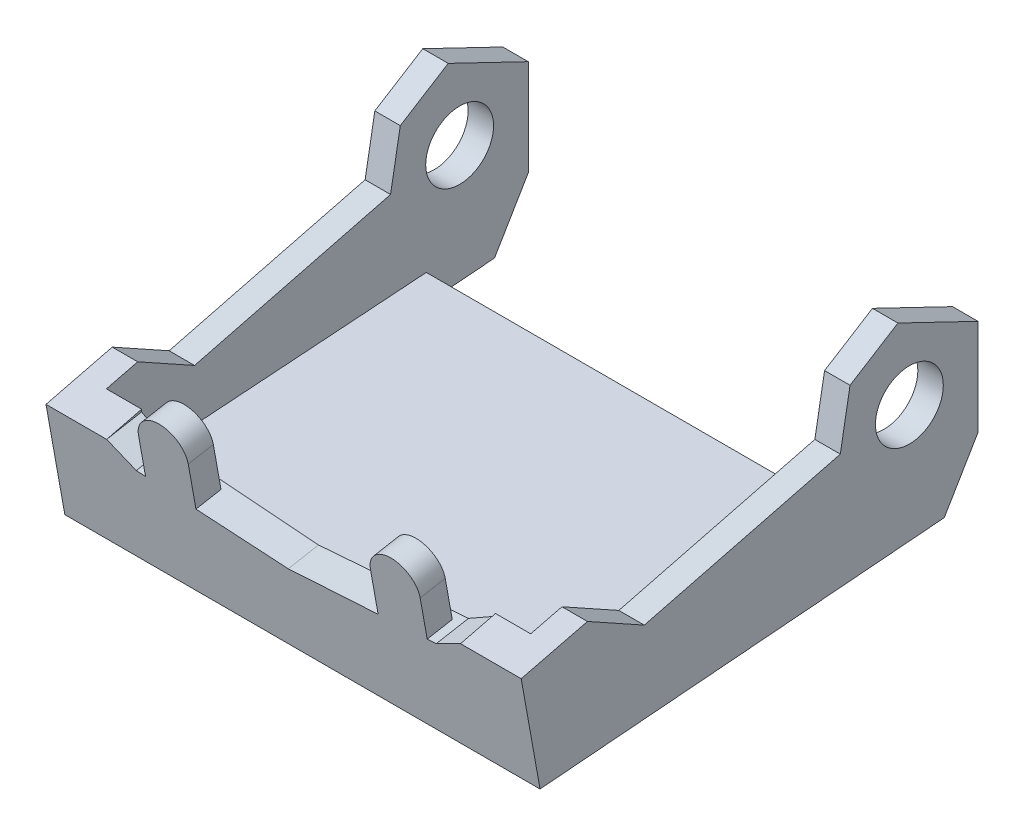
ISO-10303-21;
HEADER;
FILE_DESCRIPTION(('STEP AP214'),'2;1');
FILE_NAME('part.step','',(''),(''),'','','');
FILE_SCHEMA(('AUTOMOTIVE_DESIGN { 1 0 10303 214 1 1 1 1 }'));
ENDSEC;
DATA;
#1=APPLICATION_CONTEXT('core data for automotive mechanical design processes');
#2=APPLICATION_PROTOCOL_DEFINITION('international standard','automotive_design',2000,#1);
#3=PRODUCT_CONTEXT('',#1,'mechanical');
#4=PRODUCT('Part','Part','',(#3));
#5=PRODUCT_RELATED_PRODUCT_CATEGORY('part','',(#4));
#6=PRODUCT_DEFINITION_FORMATION('','',#4);
#7=PRODUCT_DEFINITION_CONTEXT('part definition',#1,'design');
#8=PRODUCT_DEFINITION('design','',#6,#7);
#9=PRODUCT_DEFINITION_SHAPE('','',#8);
#10=(LENGTH_UNIT() NAMED_UNIT(*) SI_UNIT(.MILLI.,.METRE.));
#11=(NAMED_UNIT(*) PLANE_ANGLE_UNIT() SI_UNIT($,.RADIAN.));
#12=(NAMED_UNIT(*) SI_UNIT($,.STERADIAN.) SOLID_ANGLE_UNIT());
#13=UNCERTAINTY_MEASURE_WITH_UNIT(LENGTH_MEASURE(1.E-05),#10,'distance_accuracy_value','');
#14=(GEOMETRIC_REPRESENTATION_CONTEXT(3) GLOBAL_UNCERTAINTY_ASSIGNED_CONTEXT((#13)) GLOBAL_UNIT_ASSIGNED_CONTEXT((#10,
#11,#12)) REPRESENTATION_CONTEXT('',''));
#15=CARTESIAN_POINT('',(0.,0.,0.));
#16=DIRECTION('',(0.,0.,1.));
#17=DIRECTION('',(1.,0.,0.));
#18=AXIS2_PLACEMENT_3D('',#15,#16,#17);
#19=CARTESIAN_POINT('',(-28.,-7.70006673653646,-24.7147024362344));
#20=DIRECTION('',(0.,-0.50924328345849,-0.860622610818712));
#21=DIRECTION('',(0.,0.860622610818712,-0.50924328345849));
#22=AXIS2_PLACEMENT_3D('',#19,#20,#21);
#23=PLANE('',#22);
#24=DIRECTION('',(0.,0.860622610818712,-0.50924328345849));
#25=VECTOR('',#24,1.);
#26=CARTESIAN_POINT('',(-25.,-7.70006673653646,-24.7147024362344));
#27=LINE('',#26,#25);
#28=CARTESIAN_POINT('',(-25.,-14.410289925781,-20.7441629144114));
#29=VERTEX_POINT('',#28);
#30=CARTESIAN_POINT('',(-25.,-7.70006673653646,-24.7147024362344));
#31=VERTEX_POINT('',#30);
#32=EDGE_CURVE('E519',#29,#31,#27,.T.);
#33=ORIENTED_EDGE('',*,*,#32,.F.);
#34=DIRECTION('',(1.,0.,0.));
#35=VECTOR('',#34,1.);
#36=CARTESIAN_POINT('',(-28.,-14.410289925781,-20.7441629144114));
#37=LINE('',#36,#35);
#38=CARTESIAN_POINT('',(-28.,-14.410289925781,-20.7441629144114));
#39=VERTEX_POINT('',#38);
#40=EDGE_CURVE('E365',#39,#29,#37,.T.);
#41=ORIENTED_EDGE('',*,*,#40,.F.);
#42=DIRECTION('',(0.,0.860622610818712,-0.50924328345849));
#43=VECTOR('',#42,1.);
#44=CARTESIAN_POINT('',(-28.,-7.70006673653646,-24.7147024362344));
#45=LINE('',#44,#43);
#46=CARTESIAN_POINT('',(-28.,-7.70006673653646,-24.7147024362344));
#47=VERTEX_POINT('',#46);
#48=EDGE_CURVE('E612',#39,#47,#45,.T.);
#49=ORIENTED_EDGE('',*,*,#48,.T.);
#50=DIRECTION('',(1.,0.,0.));
#51=VECTOR('',#50,1.);
#52=CARTESIAN_POINT('',(-28.,-7.70006673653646,-24.7147024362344));
#53=LINE('',#52,#51);
#54=EDGE_CURVE('E645',#47,#31,#53,.T.);
#55=ORIENTED_EDGE('',*,*,#54,.T.);
#56=EDGE_LOOP('',(#33,#41,#49,#55));
#57=FACE_BOUND('',#56,.T.);
#58=ADVANCED_FACE('F39',(#57),#23,.T.);
#59=CARTESIAN_POINT('',(25.,-14.410289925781,-20.7441629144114));
#60=VERTEX_POINT('',#59);
#61=CARTESIAN_POINT('',(28.,-14.410289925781,-20.7441629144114));
#62=VERTEX_POINT('',#61);
#63=EDGE_CURVE('E651',#60,#62,#37,.T.);
#64=ORIENTED_EDGE('',*,*,#63,.F.);
#65=DIRECTION('',(0.,0.860622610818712,-0.50924328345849));
#66=VECTOR('',#65,1.);
#67=CARTESIAN_POINT('',(25.,-7.70006673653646,-24.7147024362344));
#68=LINE('',#67,#66);
#69=CARTESIAN_POINT('',(25.,-7.70006673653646,-24.7147024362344));
#70=VERTEX_POINT('',#69);
#71=EDGE_CURVE('E546',#60,#70,#68,.T.);
#72=ORIENTED_EDGE('',*,*,#71,.T.);
#73=CARTESIAN_POINT('',(28.,-7.70006673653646,-24.7147024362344));
#74=VERTEX_POINT('',#73);
#75=EDGE_CURVE('E649',#70,#74,#53,.T.);
#76=ORIENTED_EDGE('',*,*,#75,.T.);
#77=DIRECTION('',(0.,0.860622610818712,-0.50924328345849));
#78=VECTOR('',#77,1.);
#79=CARTESIAN_POINT('',(28.,-7.70006673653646,-24.7147024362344));
#80=LINE('',#79,#78);
#81=EDGE_CURVE('E574',#62,#74,#80,.T.);
#82=ORIENTED_EDGE('',*,*,#81,.F.);
#83=EDGE_LOOP('',(#64,#72,#76,#82));
#84=FACE_BOUND('',#83,.T.);
#85=ADVANCED_FACE('F752',(#84),#23,.T.);
#86=CARTESIAN_POINT('',(-28.,-14.410289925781,-20.7441629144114));
#87=DIRECTION('',(0.,-0.996707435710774,-0.0810819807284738));
#88=DIRECTION('',(0.,0.0810819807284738,-0.996707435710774));
#89=AXIS2_PLACEMENT_3D('',#86,#87,#88);
#90=PLANE('',#89);
#91=ORIENTED_EDGE('',*,*,#40,.T.);
#92=DIRECTION('',(0.,-0.0810819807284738,0.996707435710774));
#93=VECTOR('',#92,1.);
#94=CARTESIAN_POINT('',(-25.,-14.410289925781,-20.7441629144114));
#95=LINE('',#94,#93);
#96=CARTESIAN_POINT('',(-25.,-15.0648179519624,-12.6983191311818));
#97=VERTEX_POINT('',#96);
#98=EDGE_CURVE('E357',#29,#97,#95,.T.);
#99=ORIENTED_EDGE('',*,*,#98,.T.);
#100=DIRECTION('',(-1.,0.,0.));
#101=VECTOR('',#100,1.);
#102=CARTESIAN_POINT('',(-28.,-15.0648179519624,-12.6983191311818));
#103=LINE('',#102,#101);
#104=CARTESIAN_POINT('',(25.,-15.0648179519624,-12.6983191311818));
#105=VERTEX_POINT('',#104);
#106=EDGE_CURVE('E342',#105,#97,#103,.T.);
#107=ORIENTED_EDGE('',*,*,#106,.F.);
#108=DIRECTION('',(0.,0.0810819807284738,-0.996707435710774));
#109=VECTOR('',#108,1.);
#110=CARTESIAN_POINT('',(25.,-14.410289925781,-20.7441629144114));
#111=LINE('',#110,#109);
#112=EDGE_CURVE('E350',#105,#60,#111,.T.);
#113=ORIENTED_EDGE('',*,*,#112,.T.);
#114=ORIENTED_EDGE('',*,*,#63,.T.);
#115=DIRECTION('',(0.,0.0810819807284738,-0.996707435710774));
#116=VECTOR('',#115,1.);
#117=CARTESIAN_POINT('',(28.,-14.410289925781,-20.7441629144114));
#118=LINE('',#117,#116);
#119=CARTESIAN_POINT('',(28.,-18.2859613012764,26.8978710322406));
#120=VERTEX_POINT('',#119);
#121=EDGE_CURVE('E570',#120,#62,#118,.T.);
#122=ORIENTED_EDGE('',*,*,#121,.F.);
#123=DIRECTION('',(1.,0.,0.));
#124=VECTOR('',#123,1.);
#125=CARTESIAN_POINT('',(-28.,-18.2859613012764,26.8978710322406));
#126=LINE('',#125,#124);
#127=CARTESIAN_POINT('',(-28.,-18.2859613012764,26.8978710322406));
#128=VERTEX_POINT('',#127);
#129=EDGE_CURVE('E652',#128,#120,#126,.T.);
#130=ORIENTED_EDGE('',*,*,#129,.F.);
#131=DIRECTION('',(0.,0.0810819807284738,-0.996707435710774));
#132=VECTOR('',#131,1.);
#133=CARTESIAN_POINT('',(-28.,-14.410289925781,-20.7441629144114));
#134=LINE('',#133,#132);
#135=EDGE_CURVE('E610',#128,#39,#134,.T.);
#136=ORIENTED_EDGE('',*,*,#135,.T.);
#137=EDGE_LOOP('',(#91,#99,#107,#113,#114,#122,#130,#136));
#138=FACE_BOUND('',#137,.T.);
#139=ADVANCED_FACE('F363',(#138),#90,.T.);
#140=CARTESIAN_POINT('',(-17.6739458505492,2.13757325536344,-25.8000364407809));
#141=DIRECTION('',(-0.0747465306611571,-0.981513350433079,-0.176194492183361));
#142=DIRECTION('',(0.,0.176688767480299,-0.984266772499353));
#143=AXIS2_PLACEMENT_3D('',#140,#141,#142);
#144=PLANE('',#143);
#145=DIRECTION('',(0.,0.176688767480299,-0.984266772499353));
#146=VECTOR('',#145,1.);
#147=CARTESIAN_POINT('',(-10.7337355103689,1.62554596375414,-25.8919520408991));
#148=LINE('',#147,#146);
#149=CARTESIAN_POINT('',(-10.7337355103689,-8.17668895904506,28.7126177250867));
#150=VERTEX_POINT('',#149);
#151=CARTESIAN_POINT('',(-10.7337355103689,-7.64662265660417,25.7598174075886));
#152=VERTEX_POINT('',#151);
#153=EDGE_CURVE('E11',#150,#152,#148,.T.);
#154=ORIENTED_EDGE('',*,*,#153,.F.);
#155=DIRECTION('',(0.997202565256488,-0.073570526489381,-0.0132068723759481));
#156=VECTOR('',#155,1.);
#157=CARTESIAN_POINT('',(-17.6739458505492,-7.66466166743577,28.8045333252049));
#158=LINE('',#157,#156);
#159=CARTESIAN_POINT('',(0.,-8.96859082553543,28.5704609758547));
#160=VERTEX_POINT('',#159);
#161=EDGE_CURVE('E448',#150,#160,#158,.T.);
#162=ORIENTED_EDGE('',*,*,#161,.T.);
#163=DIRECTION('',(0.,-0.176688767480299,0.984266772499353));
#164=VECTOR('',#163,1.);
#165=CARTESIAN_POINT('',(0.,0.83364409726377,-26.0341087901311));
#166=LINE('',#165,#164);
#167=CARTESIAN_POINT('',(0.,-8.32764635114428,25.));
#168=VERTEX_POINT('',#167);
#169=EDGE_CURVE('E469',#168,#160,#166,.T.);
#170=ORIENTED_EDGE('',*,*,#169,.F.);
#171=DIRECTION('',(-0.997112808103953,0.0759344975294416,0.));
#172=VECTOR('',#171,1.);
#173=CARTESIAN_POINT('',(25.0581867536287,-10.2359367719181,25.));
#174=LINE('',#173,#172);
#175=CARTESIAN_POINT('',(-17.6739458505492,-6.98169814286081,25.));
#176=VERTEX_POINT('',#175);
#177=EDGE_CURVE('E688',#168,#176,#174,.T.);
#178=ORIENTED_EDGE('',*,*,#177,.T.);
#179=DIRECTION('',(0.,-0.176688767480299,0.984266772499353));
#180=VECTOR('',#179,1.);
#181=CARTESIAN_POINT('',(-17.6739458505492,2.13757325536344,-25.8000364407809));
#182=LINE('',#181,#180);
#183=CARTESIAN_POINT('',(-17.6739458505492,-7.66466166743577,28.8045333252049));
#184=VERTEX_POINT('',#183);
#185=EDGE_CURVE('E473',#176,#184,#182,.T.);
#186=ORIENTED_EDGE('',*,*,#185,.T.);
#187=CARTESIAN_POINT('',(-16.5955249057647,-7.74422423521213,28.7902508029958));
#188=VERTEX_POINT('',#187);
#189=EDGE_CURVE('E449',#184,#188,#158,.T.);
#190=ORIENTED_EDGE('',*,*,#189,.T.);
#191=DIRECTION('',(0.,-0.176688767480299,0.984266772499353));
#192=VECTOR('',#191,1.);
#193=CARTESIAN_POINT('',(-16.5955249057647,2.05801068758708,-25.8143189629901));
#194=LINE('',#193,#192);
#195=CARTESIAN_POINT('',(-16.5955249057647,-7.21415793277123,25.8374504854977));
#196=VERTEX_POINT('',#195);
#197=EDGE_CURVE('E49',#196,#188,#194,.T.);
#198=ORIENTED_EDGE('',*,*,#197,.F.);
#199=DIRECTION('',(-0.997202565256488,0.0735705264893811,0.0132068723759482));
#200=VECTOR('',#199,1.);
#201=CARTESIAN_POINT('',(-17.6739458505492,-7.13459536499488,25.8517330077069));
#202=LINE('',#201,#200);
#203=EDGE_CURVE('E715',#152,#196,#202,.T.);
#204=ORIENTED_EDGE('',*,*,#203,.F.);
#205=EDGE_LOOP('',(#154,#162,#170,#178,#186,#190,#198,#204));
#206=FACE_BOUND('',#205,.T.);
#207=ADVANCED_FACE('F736',(#206),#144,.F.);
#208=CARTESIAN_POINT('',(-28.,-5.9156990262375,29.1184950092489));
#209=DIRECTION('',(0.,0.97052444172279,0.241002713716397));
#210=DIRECTION('',(0.,-0.241002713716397,0.97052444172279));
#211=AXIS2_PLACEMENT_3D('',#208,#209,#210);
#212=PLANE('',#211);
#213=DIRECTION('',(0.,-0.241002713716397,0.97052444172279));
#214=VECTOR('',#213,1.);
#215=CARTESIAN_POINT('',(-20.8512729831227,-5.9156990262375,29.1184950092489));
#216=LINE('',#215,#214);
#217=CARTESIAN_POINT('',(-20.8512729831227,-4.89298550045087,25.));
#218=VERTEX_POINT('',#217);
#219=CARTESIAN_POINT('',(-20.8512729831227,-5.9156990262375,29.1184950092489));
#220=VERTEX_POINT('',#219);
#221=EDGE_CURVE('E481',#218,#220,#216,.T.);
#222=ORIENTED_EDGE('',*,*,#221,.F.);
#223=DIRECTION('',(-1.,0.,0.));
#224=VECTOR('',#223,1.);
#225=CARTESIAN_POINT('',(-28.,-4.89298550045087,25.));
#226=LINE('',#225,#224);
#227=CARTESIAN_POINT('',(-25.,-4.89298550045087,25.));
#228=VERTEX_POINT('',#227);
#229=EDGE_CURVE('E680',#218,#228,#226,.T.);
#230=ORIENTED_EDGE('',*,*,#229,.T.);
#231=DIRECTION('',(0.,-0.241002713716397,0.97052444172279));
#232=VECTOR('',#231,1.);
#233=CARTESIAN_POINT('',(-25.,-5.9156990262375,29.1184950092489));
#234=LINE('',#233,#232);
#235=CARTESIAN_POINT('',(-25.,-3.97690688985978,21.3109266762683));
#236=VERTEX_POINT('',#235);
#237=EDGE_CURVE('E503',#236,#228,#234,.T.);
#238=ORIENTED_EDGE('',*,*,#237,.F.);
#239=DIRECTION('',(1.,0.,0.));
#240=VECTOR('',#239,1.);
#241=CARTESIAN_POINT('',(-28.,-3.97690688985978,21.3109266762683));
#242=LINE('',#241,#240);
#243=CARTESIAN_POINT('',(-28.,-3.97690688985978,21.3109266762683));
#244=VERTEX_POINT('',#243);
#245=EDGE_CURVE('E660',#244,#236,#242,.T.);
#246=ORIENTED_EDGE('',*,*,#245,.F.);
#247=DIRECTION('',(0.,-0.241002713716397,0.970524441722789));
#248=VECTOR('',#247,1.);
#249=CARTESIAN_POINT('',(-28.,-5.9156990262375,29.1184950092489));
#250=LINE('',#249,#248);
#251=CARTESIAN_POINT('',(-28.,-5.9156990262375,29.1184950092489));
#252=VERTEX_POINT('',#251);
#253=EDGE_CURVE('E602',#244,#252,#250,.T.);
#254=ORIENTED_EDGE('',*,*,#253,.T.);
#255=DIRECTION('',(1.,0.,0.));
#256=VECTOR('',#255,1.);
#257=CARTESIAN_POINT('',(-28.,-5.9156990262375,29.1184950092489));
#258=LINE('',#257,#256);
#259=EDGE_CURVE('E655',#252,#220,#258,.T.);
#260=ORIENTED_EDGE('',*,*,#259,.T.);
#261=EDGE_LOOP('',(#222,#230,#238,#246,#254,#260));
#262=FACE_BOUND('',#261,.T.);
#263=ADVANCED_FACE('F774',(#262),#212,.T.);
#264=CARTESIAN_POINT('',(-28.,-1.79891547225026,-8.48726048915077));
#265=DIRECTION('',(0.,0.174875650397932,0.984590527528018));
#266=DIRECTION('',(0.,-0.984590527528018,0.174875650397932));
#267=AXIS2_PLACEMENT_3D('',#264,#265,#266);
#268=PLANE('',#267);
#269=DIRECTION('',(1.,0.,0.));
#270=VECTOR('',#269,1.);
#271=CARTESIAN_POINT('',(-28.,4.6546644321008,-9.6334973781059));
#272=LINE('',#271,#270);
#273=CARTESIAN_POINT('',(25.,4.6546644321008,-9.6334973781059));
#274=VERTEX_POINT('',#273);
#275=CARTESIAN_POINT('',(28.,4.6546644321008,-9.6334973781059));
#276=VERTEX_POINT('',#275);
#277=EDGE_CURVE('E634',#274,#276,#272,.T.);
#278=ORIENTED_EDGE('',*,*,#277,.F.);
#279=DIRECTION('',(0.,-0.984590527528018,0.174875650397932));
#280=VECTOR('',#279,1.);
#281=CARTESIAN_POINT('',(25.,-1.79891547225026,-8.48726048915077));
#282=LINE('',#281,#280);
#283=CARTESIAN_POINT('',(25.,-1.79891547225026,-8.48726048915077));
#284=VERTEX_POINT('',#283);
#285=EDGE_CURVE('E530',#274,#284,#282,.T.);
#286=ORIENTED_EDGE('',*,*,#285,.T.);
#287=DIRECTION('',(1.,0.,0.));
#288=VECTOR('',#287,1.);
#289=CARTESIAN_POINT('',(-28.,-1.79891547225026,-8.48726048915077));
#290=LINE('',#289,#288);
#291=CARTESIAN_POINT('',(28.,-1.79891547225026,-8.48726048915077));
#292=VERTEX_POINT('',#291);
#293=EDGE_CURVE('E628',#284,#292,#290,.T.);
#294=ORIENTED_EDGE('',*,*,#293,.T.);
#295=DIRECTION('',(0.,-0.984590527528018,0.174875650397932));
#296=VECTOR('',#295,1.);
#297=CARTESIAN_POINT('',(28.,-1.79891547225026,-8.48726048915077));
#298=LINE('',#297,#296);
#299=EDGE_CURVE('E550',#276,#292,#298,.T.);
#300=ORIENTED_EDGE('',*,*,#299,.F.);
#301=EDGE_LOOP('',(#278,#286,#294,#300));
#302=FACE_BOUND('',#301,.T.);
#303=ADVANCED_FACE('F797',(#302),#268,.T.);
#304=CARTESIAN_POINT('',(-28.,4.6546644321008,-9.6334973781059));
#305=DIRECTION('',(0.,0.847998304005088,0.52999894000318));
#306=DIRECTION('',(0.,-0.52999894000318,0.847998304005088));
#307=AXIS2_PLACEMENT_3D('',#304,#305,#306);
#308=PLANE('',#307);
#309=DIRECTION('',(1.,0.,0.));
#310=VECTOR('',#309,1.);
#311=CARTESIAN_POINT('',(-28.,8.18356142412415,-15.2797325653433));
#312=LINE('',#311,#310);
#313=CARTESIAN_POINT('',(25.,8.18356142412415,-15.2797325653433));
#314=VERTEX_POINT('',#313);
#315=CARTESIAN_POINT('',(28.,8.18356142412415,-15.2797325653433));
#316=VERTEX_POINT('',#315);
#317=EDGE_CURVE('E639',#314,#316,#312,.T.);
#318=ORIENTED_EDGE('',*,*,#317,.F.);
#319=DIRECTION('',(0.,-0.52999894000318,0.847998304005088));
#320=VECTOR('',#319,1.);
#321=CARTESIAN_POINT('',(25.,4.6546644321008,-9.6334973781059));
#322=LINE('',#321,#320);
#323=EDGE_CURVE('E534',#314,#274,#322,.T.);
#324=ORIENTED_EDGE('',*,*,#323,.T.);
#325=ORIENTED_EDGE('',*,*,#277,.T.);
#326=DIRECTION('',(0.,-0.52999894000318,0.847998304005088));
#327=VECTOR('',#326,1.);
#328=CARTESIAN_POINT('',(28.,4.6546644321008,-9.6334973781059));
#329=LINE('',#328,#327);
#330=EDGE_CURVE('E586',#316,#276,#329,.T.);
#331=ORIENTED_EDGE('',*,*,#330,.F.);
#332=EDGE_LOOP('',(#318,#324,#325,#331));
#333=FACE_BOUND('',#332,.T.);
#334=ADVANCED_FACE('F1129',(#333),#308,.T.);
#335=CARTESIAN_POINT('',(-28.,8.18356142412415,-15.2797325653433));
#336=DIRECTION('',(0.,0.900998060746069,-0.433823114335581));
#337=DIRECTION('',(0.,0.433823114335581,0.900998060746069));
#338=AXIS2_PLACEMENT_3D('',#335,#336,#337);
#339=PLANE('',#338);
#340=DIRECTION('',(1.,0.,0.));
#341=VECTOR('',#340,1.);
#342=CARTESIAN_POINT('',(-28.,3.64070146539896,-24.7147024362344));
#343=LINE('',#342,#341);
#344=CARTESIAN_POINT('',(25.,3.64070146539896,-24.7147024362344));
#345=VERTEX_POINT('',#344);
#346=CARTESIAN_POINT('',(28.,3.64070146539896,-24.7147024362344));
#347=VERTEX_POINT('',#346);
#348=EDGE_CURVE('E644',#345,#347,#343,.T.);
#349=ORIENTED_EDGE('',*,*,#348,.F.);
#350=DIRECTION('',(0.,0.433823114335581,0.900998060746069));
#351=VECTOR('',#350,1.);
#352=CARTESIAN_POINT('',(25.,8.18356142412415,-15.2797325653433));
#353=LINE('',#352,#351);
#354=EDGE_CURVE('E538',#345,#314,#353,.T.);
#355=ORIENTED_EDGE('',*,*,#354,.T.);
#356=ORIENTED_EDGE('',*,*,#317,.T.);
#357=DIRECTION('',(0.,0.433823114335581,0.900998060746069));
#358=VECTOR('',#357,1.);
#359=CARTESIAN_POINT('',(28.,8.18356142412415,-15.2797325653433));
#360=LINE('',#359,#358);
#361=EDGE_CURVE('E582',#347,#316,#360,.T.);
#362=ORIENTED_EDGE('',*,*,#361,.F.);
#363=EDGE_LOOP('',(#349,#355,#356,#362));
#364=FACE_BOUND('',#363,.T.);
#365=ADVANCED_FACE('F1120',(#364),#339,.T.);
#366=CARTESIAN_POINT('',(-28.,3.64070146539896,-24.7147024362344));
#367=DIRECTION('',(0.,0.,-1.));
#368=DIRECTION('',(-1.,0.,0.));
#369=AXIS2_PLACEMENT_3D('',#366,#367,#368);
#370=PLANE('',#369);
#371=ORIENTED_EDGE('',*,*,#75,.F.);
#372=DIRECTION('',(0.,1.,0.));
#373=VECTOR('',#372,1.);
#374=CARTESIAN_POINT('',(25.,3.64070146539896,-24.7147024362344));
#375=LINE('',#374,#373);
#376=EDGE_CURVE('E542',#70,#345,#375,.T.);
#377=ORIENTED_EDGE('',*,*,#376,.T.);
#378=ORIENTED_EDGE('',*,*,#348,.T.);
#379=DIRECTION('',(0.,1.,0.));
#380=VECTOR('',#379,1.);
#381=CARTESIAN_POINT('',(28.,3.64070146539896,-24.7147024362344));
#382=LINE('',#381,#380);
#383=EDGE_CURVE('E578',#74,#347,#382,.T.);
#384=ORIENTED_EDGE('',*,*,#383,.F.);
#385=EDGE_LOOP('',(#371,#377,#378,#384));
#386=FACE_BOUND('',#385,.T.);
#387=ADVANCED_FACE('F772',(#386),#370,.T.);
#388=DIRECTION('',(0.,0.241002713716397,-0.97052444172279));
#389=VECTOR('',#388,1.);
#390=CARTESIAN_POINT('',(20.8512729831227,-5.9156990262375,29.1184950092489));
#391=LINE('',#390,#389);
#392=CARTESIAN_POINT('',(20.8512729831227,-5.9156990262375,29.1184950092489));
#393=VERTEX_POINT('',#392);
#394=CARTESIAN_POINT('',(20.8512729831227,-4.89298550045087,25.));
#395=VERTEX_POINT('',#394);
#396=EDGE_CURVE('E464',#393,#395,#391,.T.);
#397=ORIENTED_EDGE('',*,*,#396,.F.);
#398=CARTESIAN_POINT('',(28.,-5.9156990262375,29.1184950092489));
#399=VERTEX_POINT('',#398);
#400=EDGE_CURVE('E659',#393,#399,#258,.T.);
#401=ORIENTED_EDGE('',*,*,#400,.T.);
#402=DIRECTION('',(0.,-0.241002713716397,0.970524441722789));
#403=VECTOR('',#402,1.);
#404=CARTESIAN_POINT('',(28.,-5.9156990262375,29.1184950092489));
#405=LINE('',#404,#403);
#406=CARTESIAN_POINT('',(28.,-3.97690688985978,21.3109266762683));
#407=VERTEX_POINT('',#406);
#408=EDGE_CURVE('E562',#407,#399,#405,.T.);
#409=ORIENTED_EDGE('',*,*,#408,.F.);
#410=CARTESIAN_POINT('',(25.,-3.97690688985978,21.3109266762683));
#411=VERTEX_POINT('',#410);
#412=EDGE_CURVE('E664',#411,#407,#242,.T.);
#413=ORIENTED_EDGE('',*,*,#412,.F.);
#414=DIRECTION('',(0.,-0.241002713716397,0.97052444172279));
#415=VECTOR('',#414,1.);
#416=CARTESIAN_POINT('',(25.,-5.9156990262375,29.1184950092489));
#417=LINE('',#416,#415);
#418=CARTESIAN_POINT('',(25.,-4.89298550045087,25.));
#419=VERTEX_POINT('',#418);
#420=EDGE_CURVE('E526',#411,#419,#417,.T.);
#421=ORIENTED_EDGE('',*,*,#420,.T.);
#422=EDGE_CURVE('E681',#419,#395,#226,.T.);
#423=ORIENTED_EDGE('',*,*,#422,.T.);
#424=EDGE_LOOP('',(#397,#401,#409,#413,#421,#423));
#425=FACE_BOUND('',#424,.T.);
#426=ADVANCED_FACE('F768',(#425),#212,.T.);
#427=CARTESIAN_POINT('',(-28.,-3.97690688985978,21.3109266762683));
#428=DIRECTION('',(0.,0.874078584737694,-0.485784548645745));
#429=DIRECTION('',(0.,0.485784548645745,0.874078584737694));
#430=AXIS2_PLACEMENT_3D('',#427,#428,#429);
#431=PLANE('',#430);
#432=DIRECTION('',(1.,0.,0.));
#433=VECTOR('',#432,1.);
#434=CARTESIAN_POINT('',(-28.,-7.70006673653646,14.6117957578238));
#435=LINE('',#434,#433);
#436=CARTESIAN_POINT('',(25.,-7.70006673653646,14.6117957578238));
#437=VERTEX_POINT('',#436);
#438=CARTESIAN_POINT('',(28.,-7.70006673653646,14.6117957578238));
#439=VERTEX_POINT('',#438);
#440=EDGE_CURVE('E669',#437,#439,#435,.T.);
#441=ORIENTED_EDGE('',*,*,#440,.F.);
#442=DIRECTION('',(0.,0.485784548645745,0.874078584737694));
#443=VECTOR('',#442,1.);
#444=CARTESIAN_POINT('',(25.,-3.97690688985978,21.3109266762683));
#445=LINE('',#444,#443);
#446=EDGE_CURVE('E522',#437,#411,#445,.T.);
#447=ORIENTED_EDGE('',*,*,#446,.T.);
#448=ORIENTED_EDGE('',*,*,#412,.T.);
#449=DIRECTION('',(0.,0.485784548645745,0.874078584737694));
#450=VECTOR('',#449,1.);
#451=CARTESIAN_POINT('',(28.,-3.97690688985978,21.3109266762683));
#452=LINE('',#451,#450);
#453=EDGE_CURVE('E558',#439,#407,#452,.T.);
#454=ORIENTED_EDGE('',*,*,#453,.F.);
#455=EDGE_LOOP('',(#441,#447,#448,#454));
#456=FACE_BOUND('',#455,.T.);
#457=ADVANCED_FACE('F771',(#456),#431,.T.);
#458=CARTESIAN_POINT('',(-28.,-7.70006673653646,14.6117957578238));
#459=DIRECTION('',(0.,0.968882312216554,0.247521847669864));
#460=DIRECTION('',(0.,-0.247521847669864,0.968882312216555));
#461=AXIS2_PLACEMENT_3D('',#458,#459,#460);
#462=PLANE('',#461);
#463=ORIENTED_EDGE('',*,*,#293,.F.);
#464=DIRECTION('',(0.,-0.247521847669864,0.968882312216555));
#465=VECTOR('',#464,1.);
#466=CARTESIAN_POINT('',(25.,-7.70006673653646,14.6117957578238));
#467=LINE('',#466,#465);
#468=EDGE_CURVE('E676',#284,#437,#467,.T.);
#469=ORIENTED_EDGE('',*,*,#468,.T.);
#470=ORIENTED_EDGE('',*,*,#440,.T.);
#471=DIRECTION('',(0.,-0.247521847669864,0.968882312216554));
#472=VECTOR('',#471,1.);
#473=CARTESIAN_POINT('',(28.,-7.70006673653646,14.6117957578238));
#474=LINE('',#473,#472);
#475=EDGE_CURVE('E554',#292,#439,#474,.T.);
#476=ORIENTED_EDGE('',*,*,#475,.F.);
#477=EDGE_LOOP('',(#463,#469,#470,#476));
#478=FACE_BOUND('',#477,.T.);
#479=ADVANCED_FACE('F781',(#478),#462,.T.);
#480=DIRECTION('',(0.,-0.984590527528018,0.174875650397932));
#481=VECTOR('',#480,1.);
#482=CARTESIAN_POINT('',(-25.,-1.79891547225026,-8.48726048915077));
#483=LINE('',#482,#481);
#484=CARTESIAN_POINT('',(-25.,4.6546644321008,-9.6334973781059));
#485=VERTEX_POINT('',#484);
#486=CARTESIAN_POINT('',(-25.,-1.79891547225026,-8.48726048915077));
#487=VERTEX_POINT('',#486);
#488=EDGE_CURVE('E507',#485,#487,#483,.T.);
#489=ORIENTED_EDGE('',*,*,#488,.F.);
#490=CARTESIAN_POINT('',(-28.,4.6546644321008,-9.6334973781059));
#491=VERTEX_POINT('',#490);
#492=EDGE_CURVE('E629',#491,#485,#272,.T.);
#493=ORIENTED_EDGE('',*,*,#492,.F.);
#494=DIRECTION('',(0.,-0.984590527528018,0.174875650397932));
#495=VECTOR('',#494,1.);
#496=CARTESIAN_POINT('',(-28.,-1.79891547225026,-8.48726048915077));
#497=LINE('',#496,#495);
#498=CARTESIAN_POINT('',(-28.,-1.79891547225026,-8.48726048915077));
#499=VERTEX_POINT('',#498);
#500=EDGE_CURVE('E590',#491,#499,#497,.T.);
#501=ORIENTED_EDGE('',*,*,#500,.T.);
#502=EDGE_CURVE('E670',#499,#487,#290,.T.);
#503=ORIENTED_EDGE('',*,*,#502,.T.);
#504=EDGE_LOOP('',(#489,#493,#501,#503));
#505=FACE_BOUND('',#504,.T.);
#506=ADVANCED_FACE('F41',(#505),#268,.T.);
#507=DIRECTION('',(0.,-0.52999894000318,0.847998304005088));
#508=VECTOR('',#507,1.);
#509=CARTESIAN_POINT('',(-25.,4.6546644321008,-9.6334973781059));
#510=LINE('',#509,#508);
#511=CARTESIAN_POINT('',(-25.,8.18356142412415,-15.2797325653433));
#512=VERTEX_POINT('',#511);
#513=EDGE_CURVE('E510',#512,#485,#510,.T.);
#514=ORIENTED_EDGE('',*,*,#513,.F.);
#515=CARTESIAN_POINT('',(-28.,8.18356142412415,-15.2797325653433));
#516=VERTEX_POINT('',#515);
#517=EDGE_CURVE('E635',#516,#512,#312,.T.);
#518=ORIENTED_EDGE('',*,*,#517,.F.);
#519=DIRECTION('',(0.,-0.52999894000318,0.847998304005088));
#520=VECTOR('',#519,1.);
#521=CARTESIAN_POINT('',(-28.,4.6546644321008,-9.6334973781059));
#522=LINE('',#521,#520);
#523=EDGE_CURVE('E624',#516,#491,#522,.T.);
#524=ORIENTED_EDGE('',*,*,#523,.T.);
#525=ORIENTED_EDGE('',*,*,#492,.T.);
#526=EDGE_LOOP('',(#514,#518,#524,#525));
#527=FACE_BOUND('',#526,.T.);
#528=ADVANCED_FACE('F795',(#527),#308,.T.);
#529=DIRECTION('',(0.,0.433823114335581,0.900998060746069));
#530=VECTOR('',#529,1.);
#531=CARTESIAN_POINT('',(-25.,8.18356142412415,-15.2797325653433));
#532=LINE('',#531,#530);
#533=CARTESIAN_POINT('',(-25.,3.64070146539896,-24.7147024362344));
#534=VERTEX_POINT('',#533);
#535=EDGE_CURVE('E513',#534,#512,#532,.T.);
#536=ORIENTED_EDGE('',*,*,#535,.F.);
#537=CARTESIAN_POINT('',(-28.,3.64070146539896,-24.7147024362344));
#538=VERTEX_POINT('',#537);
#539=EDGE_CURVE('E640',#538,#534,#343,.T.);
#540=ORIENTED_EDGE('',*,*,#539,.F.);
#541=DIRECTION('',(0.,0.433823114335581,0.900998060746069));
#542=VECTOR('',#541,1.);
#543=CARTESIAN_POINT('',(-28.,8.18356142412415,-15.2797325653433));
#544=LINE('',#543,#542);
#545=EDGE_CURVE('E620',#538,#516,#544,.T.);
#546=ORIENTED_EDGE('',*,*,#545,.T.);
#547=ORIENTED_EDGE('',*,*,#517,.T.);
#548=EDGE_LOOP('',(#536,#540,#546,#547));
#549=FACE_BOUND('',#548,.T.);
#550=ADVANCED_FACE('F1114',(#549),#339,.T.);
#551=DIRECTION('',(0.,1.,0.));
#552=VECTOR('',#551,1.);
#553=CARTESIAN_POINT('',(-25.,3.64070146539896,-24.7147024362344));
#554=LINE('',#553,#552);
#555=EDGE_CURVE('E516',#31,#534,#554,.T.);
#556=ORIENTED_EDGE('',*,*,#555,.F.);
#557=ORIENTED_EDGE('',*,*,#54,.F.);
#558=DIRECTION('',(0.,1.,0.));
#559=VECTOR('',#558,1.);
#560=CARTESIAN_POINT('',(-28.,3.64070146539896,-24.7147024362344));
#561=LINE('',#560,#559);
#562=EDGE_CURVE('E616',#47,#538,#561,.T.);
#563=ORIENTED_EDGE('',*,*,#562,.T.);
#564=ORIENTED_EDGE('',*,*,#539,.T.);
#565=EDGE_LOOP('',(#556,#557,#563,#564));
#566=FACE_BOUND('',#565,.T.);
#567=ADVANCED_FACE('F761',(#566),#370,.T.);
#568=CARTESIAN_POINT('',(-28.,-18.2859613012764,26.8978710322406));
#569=DIRECTION('',(0.,-0.176688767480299,0.984266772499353));
#570=DIRECTION('',(0.,-0.984266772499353,-0.176688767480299));
#571=AXIS2_PLACEMENT_3D('',#568,#569,#570);
#572=PLANE('',#571);
#573=ORIENTED_EDGE('',*,*,#161,.F.);
#574=DIRECTION('',(0.,-0.984266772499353,-0.176688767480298));
#575=VECTOR('',#574,1.);
#576=CARTESIAN_POINT('',(-10.7337355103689,-3.13555021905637,29.6175681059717));
#577=LINE('',#576,#575);
#578=CARTESIAN_POINT('',(-10.7337355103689,-3.13555021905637,29.6175681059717));
#579=VERTEX_POINT('',#578);
#580=EDGE_CURVE('E391',#579,#150,#577,.T.);
#581=ORIENTED_EDGE('',*,*,#580,.F.);
#582=CARTESIAN_POINT('',(-13.6646302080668,-3.13555021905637,29.6175681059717));
#583=DIRECTION('',(0.,0.176688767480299,-0.984266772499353));
#584=DIRECTION('',(0.,-0.984266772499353,-0.176688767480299));
#585=AXIS2_PLACEMENT_3D('',#582,#583,#584);
#586=CIRCLE('',#585,2.9308946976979);
#587=CARTESIAN_POINT('',(-16.5955249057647,-3.13555021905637,29.6175681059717));
#588=VERTEX_POINT('',#587);
#589=EDGE_CURVE('E385',#588,#579,#586,.T.);
#590=ORIENTED_EDGE('',*,*,#589,.F.);
#591=DIRECTION('',(0.,0.984266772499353,0.176688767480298));
#592=VECTOR('',#591,1.);
#593=CARTESIAN_POINT('',(-16.5955249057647,-9.27716493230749,28.5150678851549));
#594=LINE('',#593,#592);
#595=EDGE_CURVE('E402',#188,#588,#594,.T.);
#596=ORIENTED_EDGE('',*,*,#595,.F.);
#597=ORIENTED_EDGE('',*,*,#189,.F.);
#598=DIRECTION('',(0.872785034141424,-0.480425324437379,-0.0862426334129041));
#599=VECTOR('',#598,1.);
#600=CARTESIAN_POINT('',(-20.8512729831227,-5.9156990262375,29.1184950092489));
#601=LINE('',#600,#599);
#602=EDGE_CURVE('E442',#220,#184,#601,.T.);
#603=ORIENTED_EDGE('',*,*,#602,.F.);
#604=ORIENTED_EDGE('',*,*,#259,.F.);
#605=DIRECTION('',(0.,-0.984266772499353,-0.176688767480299));
#606=VECTOR('',#605,1.);
#607=CARTESIAN_POINT('',(-28.,-18.2859613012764,26.8978710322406));
#608=LINE('',#607,#606);
#609=EDGE_CURVE('E606',#252,#128,#608,.T.);
#610=ORIENTED_EDGE('',*,*,#609,.T.);
#611=ORIENTED_EDGE('',*,*,#129,.T.);
#612=DIRECTION('',(0.,-0.984266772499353,-0.176688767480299));
#613=VECTOR('',#612,1.);
#614=CARTESIAN_POINT('',(28.,-18.2859613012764,26.8978710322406));
#615=LINE('',#614,#613);
#616=EDGE_CURVE('E566',#399,#120,#615,.T.);
#617=ORIENTED_EDGE('',*,*,#616,.F.);
#618=ORIENTED_EDGE('',*,*,#400,.F.);
#619=DIRECTION('',(0.872785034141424,0.480425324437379,0.0862426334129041));
#620=VECTOR('',#619,1.);
#621=CARTESIAN_POINT('',(17.6739458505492,-7.66466166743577,28.8045333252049));
#622=LINE('',#621,#620);
#623=CARTESIAN_POINT('',(17.6739458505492,-7.66466166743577,28.8045333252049));
#624=VERTEX_POINT('',#623);
#625=EDGE_CURVE('E456',#624,#393,#622,.T.);
#626=ORIENTED_EDGE('',*,*,#625,.F.);
#627=DIRECTION('',(0.997202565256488,0.073570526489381,0.0132068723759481));
#628=VECTOR('',#627,1.);
#629=CARTESIAN_POINT('',(0.,-8.96859082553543,28.5704609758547));
#630=LINE('',#629,#628);
#631=CARTESIAN_POINT('',(16.5955249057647,-7.74422423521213,28.7902508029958));
#632=VERTEX_POINT('',#631);
#633=EDGE_CURVE('E452',#632,#624,#630,.T.);
#634=ORIENTED_EDGE('',*,*,#633,.F.);
#635=DIRECTION('',(0.,0.984266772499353,0.176688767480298));
#636=VECTOR('',#635,1.);
#637=CARTESIAN_POINT('',(16.5955249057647,-9.27716493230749,28.5150678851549));
#638=LINE('',#637,#636);
#639=CARTESIAN_POINT('',(16.5955249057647,-3.13555021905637,29.6175681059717));
#640=VERTEX_POINT('',#639);
#641=EDGE_CURVE('E421',#632,#640,#638,.T.);
#642=ORIENTED_EDGE('',*,*,#641,.T.);
#643=CARTESIAN_POINT('',(13.6646302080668,-3.13555021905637,29.6175681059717));
#644=DIRECTION('',(0.,-0.176688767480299,0.984266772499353));
#645=DIRECTION('',(0.,-0.984266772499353,-0.176688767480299));
#646=AXIS2_PLACEMENT_3D('',#643,#644,#645);
#647=CIRCLE('',#646,2.9308946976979);
#648=CARTESIAN_POINT('',(10.7337355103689,-3.13555021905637,29.6175681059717));
#649=VERTEX_POINT('',#648);
#650=EDGE_CURVE('E412',#640,#649,#647,.T.);
#651=ORIENTED_EDGE('',*,*,#650,.T.);
#652=DIRECTION('',(0.,-0.984266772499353,-0.176688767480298));
#653=VECTOR('',#652,1.);
#654=CARTESIAN_POINT('',(10.7337355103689,-3.13555021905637,29.6175681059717));
#655=LINE('',#654,#653);
#656=CARTESIAN_POINT('',(10.7337355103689,-8.17668895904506,28.7126177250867));
#657=VERTEX_POINT('',#656);
#658=EDGE_CURVE('E432',#649,#657,#655,.T.);
#659=ORIENTED_EDGE('',*,*,#658,.T.);
#660=EDGE_CURVE('E453',#160,#657,#630,.T.);
#661=ORIENTED_EDGE('',*,*,#660,.F.);
#662=EDGE_LOOP('',(#573,#581,#590,#596,#597,#603,#604,#610,#611,#617,#618,#626,#634,#642,#651,
#659,#661));
#663=FACE_BOUND('',#662,.T.);
#664=ADVANCED_FACE('F727',(#663),#572,.T.);
#665=DIRECTION('',(0.,0.485784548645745,0.874078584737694));
#666=VECTOR('',#665,1.);
#667=CARTESIAN_POINT('',(-25.,-3.97690688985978,21.3109266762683));
#668=LINE('',#667,#666);
#669=CARTESIAN_POINT('',(-25.,-7.70006673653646,14.6117957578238));
#670=VERTEX_POINT('',#669);
#671=EDGE_CURVE('E500',#670,#236,#668,.T.);
#672=ORIENTED_EDGE('',*,*,#671,.F.);
#673=CARTESIAN_POINT('',(-28.,-7.70006673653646,14.6117957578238));
#674=VERTEX_POINT('',#673);
#675=EDGE_CURVE('E665',#674,#670,#435,.T.);
#676=ORIENTED_EDGE('',*,*,#675,.F.);
#677=DIRECTION('',(0.,0.485784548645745,0.874078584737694));
#678=VECTOR('',#677,1.);
#679=CARTESIAN_POINT('',(-28.,-3.97690688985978,21.3109266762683));
#680=LINE('',#679,#678);
#681=EDGE_CURVE('E598',#674,#244,#680,.T.);
#682=ORIENTED_EDGE('',*,*,#681,.T.);
#683=ORIENTED_EDGE('',*,*,#245,.T.);
#684=EDGE_LOOP('',(#672,#676,#682,#683));
#685=FACE_BOUND('',#684,.T.);
#686=ADVANCED_FACE('F767',(#685),#431,.T.);
#687=DIRECTION('',(0.,-0.247521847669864,0.968882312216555));
#688=VECTOR('',#687,1.);
#689=CARTESIAN_POINT('',(-25.,-7.70006673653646,14.6117957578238));
#690=LINE('',#689,#688);
#691=EDGE_CURVE('E633',#487,#670,#690,.T.);
#692=ORIENTED_EDGE('',*,*,#691,.F.);
#693=ORIENTED_EDGE('',*,*,#502,.F.);
#694=DIRECTION('',(0.,-0.247521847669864,0.968882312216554));
#695=VECTOR('',#694,1.);
#696=CARTESIAN_POINT('',(-28.,-7.70006673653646,14.6117957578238));
#697=LINE('',#696,#695);
#698=EDGE_CURVE('E594',#499,#674,#697,.T.);
#699=ORIENTED_EDGE('',*,*,#698,.T.);
#700=ORIENTED_EDGE('',*,*,#675,.T.);
#701=EDGE_LOOP('',(#692,#693,#699,#700));
#702=FACE_BOUND('',#701,.T.);
#703=ADVANCED_FACE('F776',(#702),#462,.T.);
#704=CARTESIAN_POINT('',(-28.,-15.606894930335,-6.03478982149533));
#705=DIRECTION('',(1.,0.,0.));
#706=DIRECTION('',(0.,0.,-1.));
#707=AXIS2_PLACEMENT_3D('',#704,#705,#706);
#708=PLANE('',#707);
#709=CARTESIAN_POINT('',(-28.,-0.844318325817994,-16.6260544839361));
#710=DIRECTION('',(1.,0.,0.));
#711=DIRECTION('',(0.,0.,-1.));
#712=AXIS2_PLACEMENT_3D('',#709,#710,#711);
#713=CIRCLE('',#712,4.);
#714=CARTESIAN_POINT('',(-28.,-0.844318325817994,-20.6260544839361));
#715=VERTEX_POINT('',#714);
#716=EDGE_CURVE('E373',#715,#715,#713,.T.);
#717=ORIENTED_EDGE('',*,*,#716,.T.);
#718=EDGE_LOOP('',(#717));
#719=FACE_BOUND('',#718,.T.);
#720=ORIENTED_EDGE('',*,*,#500,.F.);
#721=ORIENTED_EDGE('',*,*,#523,.F.);
#722=ORIENTED_EDGE('',*,*,#545,.F.);
#723=ORIENTED_EDGE('',*,*,#562,.F.);
#724=ORIENTED_EDGE('',*,*,#48,.F.);
#725=ORIENTED_EDGE('',*,*,#135,.F.);
#726=ORIENTED_EDGE('',*,*,#609,.F.);
#727=ORIENTED_EDGE('',*,*,#253,.F.);
#728=ORIENTED_EDGE('',*,*,#681,.F.);
#729=ORIENTED_EDGE('',*,*,#698,.F.);
#730=EDGE_LOOP('',(#720,#721,#722,#723,#724,#725,#726,#727,#728,#729));
#731=FACE_BOUND('',#730,.T.);
#732=ADVANCED_FACE('F779',(#719,#731),#708,.F.);
#733=CARTESIAN_POINT('',(28.,-15.606894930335,-6.03478982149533));
#734=DIRECTION('',(1.,0.,0.));
#735=DIRECTION('',(0.,0.,-1.));
#736=AXIS2_PLACEMENT_3D('',#733,#734,#735);
#737=PLANE('',#736);
#738=CARTESIAN_POINT('',(28.,-0.844318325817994,-16.6260544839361));
#739=DIRECTION('',(1.,0.,0.));
#740=DIRECTION('',(0.,0.,-1.));
#741=AXIS2_PLACEMENT_3D('',#738,#739,#740);
#742=CIRCLE('',#741,4.);
#743=CARTESIAN_POINT('',(28.,-0.844318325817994,-20.6260544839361));
#744=VERTEX_POINT('',#743);
#745=EDGE_CURVE('E367',#744,#744,#742,.T.);
#746=ORIENTED_EDGE('',*,*,#745,.F.);
#747=EDGE_LOOP('',(#746));
#748=FACE_BOUND('',#747,.T.);
#749=ORIENTED_EDGE('',*,*,#299,.T.);
#750=ORIENTED_EDGE('',*,*,#475,.T.);
#751=ORIENTED_EDGE('',*,*,#453,.T.);
#752=ORIENTED_EDGE('',*,*,#408,.T.);
#753=ORIENTED_EDGE('',*,*,#616,.T.);
#754=ORIENTED_EDGE('',*,*,#121,.T.);
#755=ORIENTED_EDGE('',*,*,#81,.T.);
#756=ORIENTED_EDGE('',*,*,#383,.T.);
#757=ORIENTED_EDGE('',*,*,#361,.T.);
#758=ORIENTED_EDGE('',*,*,#330,.T.);
#759=EDGE_LOOP('',(#749,#750,#751,#752,#753,#754,#755,#756,#757,#758));
#760=FACE_BOUND('',#759,.T.);
#761=ADVANCED_FACE('F785',(#748,#760),#737,.T.);
#762=CARTESIAN_POINT('',(25.,-11.,25.));
#763=DIRECTION('',(0.,0.,-1.));
#764=DIRECTION('',(-1.,0.,0.));
#765=AXIS2_PLACEMENT_3D('',#762,#763,#764);
#766=PLANE('',#765);
#767=DIRECTION('',(0.,1.,0.));
#768=VECTOR('',#767,1.);
#769=CARTESIAN_POINT('',(-20.8512729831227,-11.,25.));
#770=LINE('',#769,#768);
#771=CARTESIAN_POINT('',(-20.8512729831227,-5.17637527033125,25.));
#772=VERTEX_POINT('',#771);
#773=EDGE_CURVE('E701',#772,#218,#770,.T.);
#774=ORIENTED_EDGE('',*,*,#773,.F.);
#775=DIRECTION('',(-0.869453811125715,0.494014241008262,0.));
#776=VECTOR('',#775,1.);
#777=CARTESIAN_POINT('',(16.3113718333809,-26.291787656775,25.));
#778=LINE('',#777,#776);
#779=EDGE_CURVE('E685',#176,#772,#778,.T.);
#780=ORIENTED_EDGE('',*,*,#779,.F.);
#781=ORIENTED_EDGE('',*,*,#177,.F.);
#782=DIRECTION('',(-0.997112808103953,-0.0759344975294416,0.));
#783=VECTOR('',#782,1.);
#784=CARTESIAN_POINT('',(24.6535108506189,-6.45017376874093,25.));
#785=LINE('',#784,#783);
#786=CARTESIAN_POINT('',(17.6739458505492,-6.98169814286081,25.));
#787=VERTEX_POINT('',#786);
#788=EDGE_CURVE('E692',#787,#168,#785,.T.);
#789=ORIENTED_EDGE('',*,*,#788,.F.);
#790=DIRECTION('',(-0.869453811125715,-0.494014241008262,0.));
#791=VECTOR('',#790,1.);
#792=CARTESIAN_POINT('',(21.4861246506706,-4.81565942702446,25.));
#793=LINE('',#792,#791);
#794=CARTESIAN_POINT('',(20.8512729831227,-5.17637527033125,25.));
#795=VERTEX_POINT('',#794);
#796=EDGE_CURVE('E695',#795,#787,#793,.T.);
#797=ORIENTED_EDGE('',*,*,#796,.F.);
#798=DIRECTION('',(0.,-1.,0.));
#799=VECTOR('',#798,1.);
#800=CARTESIAN_POINT('',(20.8512729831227,-11.,25.));
#801=LINE('',#800,#799);
#802=EDGE_CURVE('E698',#395,#795,#801,.T.);
#803=ORIENTED_EDGE('',*,*,#802,.F.);
#804=ORIENTED_EDGE('',*,*,#422,.F.);
#805=DIRECTION('',(0.,-1.,0.));
#806=VECTOR('',#805,1.);
#807=CARTESIAN_POINT('',(25.,-11.,25.));
#808=LINE('',#807,#806);
#809=CARTESIAN_POINT('',(25.,-14.4996206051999,25.));
#810=VERTEX_POINT('',#809);
#811=EDGE_CURVE('E489',#419,#810,#808,.T.);
#812=ORIENTED_EDGE('',*,*,#811,.T.);
#813=DIRECTION('',(-1.,0.,0.));
#814=VECTOR('',#813,1.);
#815=CARTESIAN_POINT('',(25.,-14.4996206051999,25.));
#816=LINE('',#815,#814);
#817=CARTESIAN_POINT('',(-25.,-14.4996206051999,25.));
#818=VERTEX_POINT('',#817);
#819=EDGE_CURVE('E496',#810,#818,#816,.T.);
#820=ORIENTED_EDGE('',*,*,#819,.T.);
#821=DIRECTION('',(0.,-1.,0.));
#822=VECTOR('',#821,1.);
#823=CARTESIAN_POINT('',(-25.,-11.,25.));
#824=LINE('',#823,#822);
#825=EDGE_CURVE('E484',#228,#818,#824,.T.);
#826=ORIENTED_EDGE('',*,*,#825,.F.);
#827=ORIENTED_EDGE('',*,*,#229,.F.);
#828=EDGE_LOOP('',(#774,#780,#781,#789,#797,#803,#804,#812,#820,#826,#827));
#829=FACE_BOUND('',#828,.T.);
#830=ADVANCED_FACE('F826',(#829),#766,.T.);
#831=CARTESIAN_POINT('',(25.,-14.4996206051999,25.));
#832=DIRECTION('',(0.,0.99755949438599,0.0698215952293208));
#833=DIRECTION('',(0.,-0.0698215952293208,0.99755949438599));
#834=AXIS2_PLACEMENT_3D('',#831,#832,#833);
#835=PLANE('',#834);
#836=DIRECTION('',(1.,0.,0.));
#837=VECTOR('',#836,1.);
#838=CARTESIAN_POINT('',(25.,-11.8610243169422,-12.6983191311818));
#839=LINE('',#838,#837);
#840=CARTESIAN_POINT('',(-25.,-11.8610243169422,-12.6983191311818));
#841=VERTEX_POINT('',#840);
#842=CARTESIAN_POINT('',(25.,-11.8610243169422,-12.6983191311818));
#843=VERTEX_POINT('',#842);
#844=EDGE_CURVE('E351',#841,#843,#839,.T.);
#845=ORIENTED_EDGE('',*,*,#844,.F.);
#846=DIRECTION('',(0.,0.0698215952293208,-0.99755949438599));
#847=VECTOR('',#846,1.);
#848=CARTESIAN_POINT('',(-25.,-14.4996206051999,25.));
#849=LINE('',#848,#847);
#850=EDGE_CURVE('E360',#818,#841,#849,.T.);
#851=ORIENTED_EDGE('',*,*,#850,.F.);
#852=ORIENTED_EDGE('',*,*,#819,.F.);
#853=DIRECTION('',(0.,0.0698215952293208,-0.99755949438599));
#854=VECTOR('',#853,1.);
#855=CARTESIAN_POINT('',(25.,-14.4996206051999,25.));
#856=LINE('',#855,#854);
#857=EDGE_CURVE('E492',#810,#843,#856,.T.);
#858=ORIENTED_EDGE('',*,*,#857,.T.);
#859=EDGE_LOOP('',(#845,#851,#852,#858));
#860=FACE_BOUND('',#859,.T.);
#861=ADVANCED_FACE('F822',(#860),#835,.T.);
#862=CARTESIAN_POINT('',(25.,11.,-25.));
#863=DIRECTION('',(-1.,0.,0.));
#864=DIRECTION('',(0.,0.,1.));
#865=AXIS2_PLACEMENT_3D('',#862,#863,#864);
#866=PLANE('',#865);
#867=ORIENTED_EDGE('',*,*,#71,.F.);
#868=ORIENTED_EDGE('',*,*,#112,.F.);
#869=DIRECTION('',(0.,1.,0.));
#870=VECTOR('',#869,1.);
#871=CARTESIAN_POINT('',(25.,-10.3434888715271,-12.6983191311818));
#872=LINE('',#871,#870);
#873=EDGE_CURVE('E345',#105,#843,#872,.T.);
#874=ORIENTED_EDGE('',*,*,#873,.T.);
#875=ORIENTED_EDGE('',*,*,#857,.F.);
#876=ORIENTED_EDGE('',*,*,#811,.F.);
#877=ORIENTED_EDGE('',*,*,#420,.F.);
#878=ORIENTED_EDGE('',*,*,#446,.F.);
#879=ORIENTED_EDGE('',*,*,#468,.F.);
#880=ORIENTED_EDGE('',*,*,#285,.F.);
#881=ORIENTED_EDGE('',*,*,#323,.F.);
#882=ORIENTED_EDGE('',*,*,#354,.F.);
#883=ORIENTED_EDGE('',*,*,#376,.F.);
#884=EDGE_LOOP('',(#867,#868,#874,#875,#876,#877,#878,#879,#880,#881,#882,#883));
#885=FACE_BOUND('',#884,.T.);
#886=CARTESIAN_POINT('',(25.,-0.844318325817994,-16.6260544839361));
#887=DIRECTION('',(-1.,0.,0.));
#888=DIRECTION('',(0.,0.,1.));
#889=AXIS2_PLACEMENT_3D('',#886,#887,#888);
#890=CIRCLE('',#889,4.);
#891=CARTESIAN_POINT('',(25.,-0.844318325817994,-12.6260544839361));
#892=VERTEX_POINT('',#891);
#893=EDGE_CURVE('E381',#892,#892,#890,.T.);
#894=ORIENTED_EDGE('',*,*,#893,.F.);
#895=EDGE_LOOP('',(#894));
#896=FACE_BOUND('',#895,.T.);
#897=ADVANCED_FACE('F817',(#885,#896),#866,.T.);
#898=CARTESIAN_POINT('',(-25.,11.,-25.));
#899=DIRECTION('',(-1.,0.,0.));
#900=DIRECTION('',(0.,0.,1.));
#901=AXIS2_PLACEMENT_3D('',#898,#899,#900);
#902=PLANE('',#901);
#903=CARTESIAN_POINT('',(-25.,-0.844318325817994,-16.6260544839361));
#904=DIRECTION('',(-1.,0.,0.));
#905=DIRECTION('',(0.,0.,1.));
#906=AXIS2_PLACEMENT_3D('',#903,#904,#905);
#907=CIRCLE('',#906,4.);
#908=CARTESIAN_POINT('',(-25.,-0.844318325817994,-12.6260544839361));
#909=VERTEX_POINT('',#908);
#910=EDGE_CURVE('E43',#909,#909,#907,.T.);
#911=ORIENTED_EDGE('',*,*,#910,.T.);
#912=EDGE_LOOP('',(#911));
#913=FACE_BOUND('',#912,.T.);
#914=ORIENTED_EDGE('',*,*,#850,.T.);
#915=DIRECTION('',(0.,-1.,0.));
#916=VECTOR('',#915,1.);
#917=CARTESIAN_POINT('',(-25.,-15.2211097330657,-12.6983191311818));
#918=LINE('',#917,#916);
#919=EDGE_CURVE('E59',#841,#97,#918,.T.);
#920=ORIENTED_EDGE('',*,*,#919,.T.);
#921=ORIENTED_EDGE('',*,*,#98,.F.);
#922=ORIENTED_EDGE('',*,*,#32,.T.);
#923=ORIENTED_EDGE('',*,*,#555,.T.);
#924=ORIENTED_EDGE('',*,*,#535,.T.);
#925=ORIENTED_EDGE('',*,*,#513,.T.);
#926=ORIENTED_EDGE('',*,*,#488,.T.);
#927=ORIENTED_EDGE('',*,*,#691,.T.);
#928=ORIENTED_EDGE('',*,*,#671,.T.);
#929=ORIENTED_EDGE('',*,*,#237,.T.);
#930=ORIENTED_EDGE('',*,*,#825,.T.);
#931=EDGE_LOOP('',(#914,#920,#921,#922,#923,#924,#925,#926,#927,#928,#929,#930));
#932=FACE_BOUND('',#931,.T.);
#933=ADVANCED_FACE('F356',(#913,#932),#902,.F.);
#934=CARTESIAN_POINT('',(-20.8512729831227,3.8865358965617,-25.4860747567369));
#935=DIRECTION('',(-1.,0.,0.));
#936=DIRECTION('',(0.,0.,1.));
#937=AXIS2_PLACEMENT_3D('',#934,#935,#936);
#938=PLANE('',#937);
#939=ORIENTED_EDGE('',*,*,#221,.T.);
#940=DIRECTION('',(0.,-0.176688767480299,0.984266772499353));
#941=VECTOR('',#940,1.);
#942=CARTESIAN_POINT('',(-20.8512729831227,3.8865358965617,-25.4860747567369));
#943=LINE('',#942,#941);
#944=EDGE_CURVE('E460',#772,#220,#943,.T.);
#945=ORIENTED_EDGE('',*,*,#944,.F.);
#946=ORIENTED_EDGE('',*,*,#773,.T.);
#947=EDGE_LOOP('',(#939,#945,#946));
#948=FACE_BOUND('',#947,.T.);
#949=ADVANCED_FACE('F943',(#948),#938,.F.);
#950=CARTESIAN_POINT('',(20.8512729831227,3.8865358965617,-25.4860747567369));
#951=DIRECTION('',(1.,0.,0.));
#952=DIRECTION('',(0.,0.,-1.));
#953=AXIS2_PLACEMENT_3D('',#950,#951,#952);
#954=PLANE('',#953);
#955=ORIENTED_EDGE('',*,*,#396,.T.);
#956=ORIENTED_EDGE('',*,*,#802,.T.);
#957=DIRECTION('',(0.,-0.176688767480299,0.984266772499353));
#958=VECTOR('',#957,1.);
#959=CARTESIAN_POINT('',(20.8512729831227,3.8865358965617,-25.4860747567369));
#960=LINE('',#959,#958);
#961=EDGE_CURVE('E461',#795,#393,#960,.T.);
#962=ORIENTED_EDGE('',*,*,#961,.T.);
#963=EDGE_LOOP('',(#955,#956,#962));
#964=FACE_BOUND('',#963,.T.);
#965=ADVANCED_FACE('F1022',(#964),#954,.F.);
#966=CARTESIAN_POINT('',(17.6739458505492,2.13757325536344,-25.8000364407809));
#967=DIRECTION('',(0.488104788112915,-0.859053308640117,-0.154211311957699));
#968=DIRECTION('',(0.869453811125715,0.494014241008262,0.));
#969=AXIS2_PLACEMENT_3D('',#966,#967,#968);
#970=PLANE('',#969);
#971=ORIENTED_EDGE('',*,*,#796,.T.);
#972=DIRECTION('',(0.,-0.176688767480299,0.984266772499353));
#973=VECTOR('',#972,1.);
#974=CARTESIAN_POINT('',(17.6739458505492,2.13757325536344,-25.8000364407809));
#975=LINE('',#974,#973);
#976=EDGE_CURVE('E465',#787,#624,#975,.T.);
#977=ORIENTED_EDGE('',*,*,#976,.T.);
#978=ORIENTED_EDGE('',*,*,#625,.T.);
#979=ORIENTED_EDGE('',*,*,#961,.F.);
#980=EDGE_LOOP('',(#971,#977,#978,#979));
#981=FACE_BOUND('',#980,.T.);
#982=ADVANCED_FACE('F1032',(#981),#970,.F.);
#983=CARTESIAN_POINT('',(0.,0.83364409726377,-26.0341087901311));
#984=DIRECTION('',(0.0747465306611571,-0.981513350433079,-0.176194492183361));
#985=DIRECTION('',(0.,0.176688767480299,-0.984266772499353));
#986=AXIS2_PLACEMENT_3D('',#983,#984,#985);
#987=PLANE('',#986);
#988=DIRECTION('',(-0.997202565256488,-0.0735705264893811,-0.0132068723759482));
#989=VECTOR('',#988,1.);
#990=CARTESIAN_POINT('',(0.,-8.43852452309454,25.6176606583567));
#991=LINE('',#990,#989);
#992=CARTESIAN_POINT('',(16.5955249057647,-7.21415793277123,25.8374504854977));
#993=VERTEX_POINT('',#992);
#994=CARTESIAN_POINT('',(10.7337355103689,-7.64662265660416,25.7598174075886));
#995=VERTEX_POINT('',#994);
#996=EDGE_CURVE('E704',#993,#995,#991,.T.);
#997=ORIENTED_EDGE('',*,*,#996,.F.);
#998=DIRECTION('',(0.,-0.176688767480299,0.984266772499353));
#999=VECTOR('',#998,1.);
#1000=CARTESIAN_POINT('',(16.5955249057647,2.05801068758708,-25.8143189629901));
#1001=LINE('',#1000,#999);
#1002=EDGE_CURVE('E711',#993,#632,#1001,.T.);
#1003=ORIENTED_EDGE('',*,*,#1002,.T.);
#1004=ORIENTED_EDGE('',*,*,#633,.T.);
#1005=ORIENTED_EDGE('',*,*,#976,.F.);
#1006=ORIENTED_EDGE('',*,*,#788,.T.);
#1007=ORIENTED_EDGE('',*,*,#169,.T.);
#1008=ORIENTED_EDGE('',*,*,#660,.T.);
#1009=DIRECTION('',(0.,0.176688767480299,-0.984266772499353));
#1010=VECTOR('',#1009,1.);
#1011=CARTESIAN_POINT('',(10.7337355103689,1.62554596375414,-25.8919520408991));
#1012=LINE('',#1011,#1010);
#1013=EDGE_CURVE('E708',#657,#995,#1012,.T.);
#1014=ORIENTED_EDGE('',*,*,#1013,.T.);
#1015=EDGE_LOOP('',(#997,#1003,#1004,#1005,#1006,#1007,#1008,#1014));
#1016=FACE_BOUND('',#1015,.T.);
#1017=ADVANCED_FACE('F1042',(#1016),#987,.F.);
#1018=CARTESIAN_POINT('',(-20.8512729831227,3.8865358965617,-25.4860747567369));
#1019=DIRECTION('',(-0.488104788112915,-0.859053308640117,-0.154211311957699));
#1020=DIRECTION('',(0.869453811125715,-0.494014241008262,0.));
#1021=AXIS2_PLACEMENT_3D('',#1018,#1019,#1020);
#1022=PLANE('',#1021);
#1023=ORIENTED_EDGE('',*,*,#779,.T.);
#1024=ORIENTED_EDGE('',*,*,#944,.T.);
#1025=ORIENTED_EDGE('',*,*,#602,.T.);
#1026=ORIENTED_EDGE('',*,*,#185,.F.);
#1027=EDGE_LOOP('',(#1023,#1024,#1025,#1026));
#1028=FACE_BOUND('',#1027,.T.);
#1029=ADVANCED_FACE('F1050',(#1028),#1022,.F.);
#1030=CARTESIAN_POINT('',(16.5955249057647,-8.74709862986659,25.5622675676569));
#1031=DIRECTION('',(1.,0.,0.));
#1032=DIRECTION('',(0.,0.,-1.));
#1033=AXIS2_PLACEMENT_3D('',#1030,#1031,#1032);
#1034=PLANE('',#1033);
#1035=ORIENTED_EDGE('',*,*,#1002,.F.);
#1036=DIRECTION('',(0.,0.984266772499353,0.176688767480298));
#1037=VECTOR('',#1036,1.);
#1038=CARTESIAN_POINT('',(16.5955249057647,-8.74709862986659,25.5622675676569));
#1039=LINE('',#1038,#1037);
#1040=CARTESIAN_POINT('',(16.5955249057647,-2.60548391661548,26.6647677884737));
#1041=VERTEX_POINT('',#1040);
#1042=EDGE_CURVE('E425',#993,#1041,#1039,.T.);
#1043=ORIENTED_EDGE('',*,*,#1042,.T.);
#1044=DIRECTION('',(0.,-0.176688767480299,0.984266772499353));
#1045=VECTOR('',#1044,1.);
#1046=CARTESIAN_POINT('',(16.5955249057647,-2.60548391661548,26.6647677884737));
#1047=LINE('',#1046,#1045);
#1048=EDGE_CURVE('E438',#1041,#640,#1047,.T.);
#1049=ORIENTED_EDGE('',*,*,#1048,.T.);
#1050=ORIENTED_EDGE('',*,*,#641,.F.);
#1051=EDGE_LOOP('',(#1035,#1043,#1049,#1050));
#1052=FACE_BOUND('',#1051,.T.);
#1053=ADVANCED_FACE('F1055',(#1052),#1034,.T.);
#1054=CARTESIAN_POINT('',(10.7337355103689,-2.60548391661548,26.6647677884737));
#1055=DIRECTION('',(-1.,0.,0.));
#1056=DIRECTION('',(0.,-1.,0.));
#1057=AXIS2_PLACEMENT_3D('',#1054,#1055,#1056);
#1058=PLANE('',#1057);
#1059=ORIENTED_EDGE('',*,*,#1013,.F.);
#1060=ORIENTED_EDGE('',*,*,#658,.F.);
#1061=DIRECTION('',(0.,-0.176688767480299,0.984266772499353));
#1062=VECTOR('',#1061,1.);
#1063=CARTESIAN_POINT('',(10.7337355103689,-2.60548391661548,26.6647677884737));
#1064=LINE('',#1063,#1062);
#1065=CARTESIAN_POINT('',(10.7337355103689,-2.60548391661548,26.6647677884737));
#1066=VERTEX_POINT('',#1065);
#1067=EDGE_CURVE('E428',#1066,#649,#1064,.T.);
#1068=ORIENTED_EDGE('',*,*,#1067,.F.);
#1069=DIRECTION('',(0.,-0.984266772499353,-0.176688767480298));
#1070=VECTOR('',#1069,1.);
#1071=CARTESIAN_POINT('',(10.7337355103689,-2.60548391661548,26.6647677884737));
#1072=LINE('',#1071,#1070);
#1073=EDGE_CURVE('E420',#1066,#995,#1072,.T.);
#1074=ORIENTED_EDGE('',*,*,#1073,.T.);
#1075=EDGE_LOOP('',(#1059,#1060,#1068,#1074));
#1076=FACE_BOUND('',#1075,.T.);
#1077=ADVANCED_FACE('F961',(#1076),#1058,.T.);
#1078=CARTESIAN_POINT('',(13.6646302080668,-2.60548391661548,26.6647677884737));
#1079=DIRECTION('',(0.,-0.176688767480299,0.984266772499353));
#1080=DIRECTION('',(0.,-0.984266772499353,-0.176688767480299));
#1081=AXIS2_PLACEMENT_3D('',#1078,#1079,#1080);
#1082=PLANE('',#1081);
#1083=ORIENTED_EDGE('',*,*,#1042,.F.);
#1084=ORIENTED_EDGE('',*,*,#996,.T.);
#1085=ORIENTED_EDGE('',*,*,#1073,.F.);
#1086=CARTESIAN_POINT('',(13.6646302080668,-2.60548391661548,26.6647677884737));
#1087=DIRECTION('',(0.,-0.176688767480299,0.984266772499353));
#1088=DIRECTION('',(0.,-0.984266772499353,-0.176688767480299));
#1089=AXIS2_PLACEMENT_3D('',#1086,#1087,#1088);
#1090=CIRCLE('',#1089,2.9308946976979);
#1091=EDGE_CURVE('E416',#1041,#1066,#1090,.T.);
#1092=ORIENTED_EDGE('',*,*,#1091,.F.);
#1093=EDGE_LOOP('',(#1083,#1084,#1085,#1092));
#1094=FACE_BOUND('',#1093,.T.);
#1095=ADVANCED_FACE('F747',(#1094),#1082,.F.);
#1096=CARTESIAN_POINT('',(13.6646302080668,-2.60548391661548,26.6647677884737));
#1097=DIRECTION('',(0.,-0.176688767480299,0.984266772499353));
#1098=DIRECTION('',(0.,-0.984266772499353,-0.176688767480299));
#1099=AXIS2_PLACEMENT_3D('',#1096,#1097,#1098);
#1100=CYLINDRICAL_SURFACE('',#1099,2.9308946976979);
#1101=ORIENTED_EDGE('',*,*,#650,.F.);
#1102=ORIENTED_EDGE('',*,*,#1048,.F.);
#1103=ORIENTED_EDGE('',*,*,#1091,.T.);
#1104=ORIENTED_EDGE('',*,*,#1067,.T.);
#1105=EDGE_LOOP('',(#1101,#1102,#1103,#1104));
#1106=FACE_BOUND('',#1105,.T.);
#1107=ADVANCED_FACE('F740',(#1106),#1100,.T.);
#1108=CARTESIAN_POINT('',(-10.7337355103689,-2.60548391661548,26.6647677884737));
#1109=DIRECTION('',(-1.,0.,0.));
#1110=DIRECTION('',(0.,-1.,0.));
#1111=AXIS2_PLACEMENT_3D('',#1108,#1109,#1110);
#1112=PLANE('',#1111);
#1113=ORIENTED_EDGE('',*,*,#580,.T.);
#1114=ORIENTED_EDGE('',*,*,#153,.T.);
#1115=DIRECTION('',(0.,-0.984266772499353,-0.176688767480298));
#1116=VECTOR('',#1115,1.);
#1117=CARTESIAN_POINT('',(-10.7337355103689,-2.60548391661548,26.6647677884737));
#1118=LINE('',#1117,#1116);
#1119=CARTESIAN_POINT('',(-10.7337355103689,-2.60548391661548,26.6647677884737));
#1120=VERTEX_POINT('',#1119);
#1121=EDGE_CURVE('E394',#1120,#152,#1118,.T.);
#1122=ORIENTED_EDGE('',*,*,#1121,.F.);
#1123=DIRECTION('',(0.,-0.176688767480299,0.984266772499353));
#1124=VECTOR('',#1123,1.);
#1125=CARTESIAN_POINT('',(-10.7337355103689,-2.60548391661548,26.6647677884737));
#1126=LINE('',#1125,#1124);
#1127=EDGE_CURVE('E408',#1120,#579,#1126,.T.);
#1128=ORIENTED_EDGE('',*,*,#1127,.T.);
#1129=EDGE_LOOP('',(#1113,#1114,#1122,#1128));
#1130=FACE_BOUND('',#1129,.T.);
#1131=ADVANCED_FACE('F738',(#1130),#1112,.F.);
#1132=CARTESIAN_POINT('',(-16.5955249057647,-8.74709862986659,25.5622675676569));
#1133=DIRECTION('',(1.,0.,0.));
#1134=DIRECTION('',(0.,0.,-1.));
#1135=AXIS2_PLACEMENT_3D('',#1132,#1133,#1134);
#1136=PLANE('',#1135);
#1137=DIRECTION('',(0.,0.984266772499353,0.176688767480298));
#1138=VECTOR('',#1137,1.);
#1139=CARTESIAN_POINT('',(-16.5955249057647,-8.74709862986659,25.5622675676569));
#1140=LINE('',#1139,#1138);
#1141=CARTESIAN_POINT('',(-16.5955249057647,-2.60548391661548,26.6647677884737));
#1142=VERTEX_POINT('',#1141);
#1143=EDGE_CURVE('E390',#196,#1142,#1140,.T.);
#1144=ORIENTED_EDGE('',*,*,#1143,.F.);
#1145=ORIENTED_EDGE('',*,*,#197,.T.);
#1146=ORIENTED_EDGE('',*,*,#595,.T.);
#1147=DIRECTION('',(0.,-0.176688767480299,0.984266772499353));
#1148=VECTOR('',#1147,1.);
#1149=CARTESIAN_POINT('',(-16.5955249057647,-2.60548391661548,26.6647677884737));
#1150=LINE('',#1149,#1148);
#1151=EDGE_CURVE('E398',#1142,#588,#1150,.T.);
#1152=ORIENTED_EDGE('',*,*,#1151,.F.);
#1153=EDGE_LOOP('',(#1144,#1145,#1146,#1152));
#1154=FACE_BOUND('',#1153,.T.);
#1155=ADVANCED_FACE('F722',(#1154),#1136,.F.);
#1156=CARTESIAN_POINT('',(-13.6646302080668,-2.60548391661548,26.6647677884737));
#1157=DIRECTION('',(0.,-0.176688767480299,0.984266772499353));
#1158=DIRECTION('',(0.,-0.984266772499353,-0.176688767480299));
#1159=AXIS2_PLACEMENT_3D('',#1156,#1157,#1158);
#1160=PLANE('',#1159);
#1161=ORIENTED_EDGE('',*,*,#1121,.T.);
#1162=ORIENTED_EDGE('',*,*,#203,.T.);
#1163=ORIENTED_EDGE('',*,*,#1143,.T.);
#1164=CARTESIAN_POINT('',(-13.6646302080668,-2.60548391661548,26.6647677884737));
#1165=DIRECTION('',(0.,0.176688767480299,-0.984266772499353));
#1166=DIRECTION('',(0.,-0.984266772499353,-0.176688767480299));
#1167=AXIS2_PLACEMENT_3D('',#1164,#1165,#1166);
#1168=CIRCLE('',#1167,2.9308946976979);
#1169=EDGE_CURVE('E386',#1142,#1120,#1168,.T.);
#1170=ORIENTED_EDGE('',*,*,#1169,.T.);
#1171=EDGE_LOOP('',(#1161,#1162,#1163,#1170));
#1172=FACE_BOUND('',#1171,.T.);
#1173=ADVANCED_FACE('F734',(#1172),#1160,.F.);
#1174=CARTESIAN_POINT('',(-13.6646302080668,-2.60548391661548,26.6647677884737));
#1175=DIRECTION('',(0.,-0.176688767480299,0.984266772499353));
#1176=DIRECTION('',(0.,-0.984266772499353,-0.176688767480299));
#1177=AXIS2_PLACEMENT_3D('',#1174,#1175,#1176);
#1178=CYLINDRICAL_SURFACE('',#1177,2.9308946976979);
#1179=ORIENTED_EDGE('',*,*,#589,.T.);
#1180=ORIENTED_EDGE('',*,*,#1127,.F.);
#1181=ORIENTED_EDGE('',*,*,#1169,.F.);
#1182=ORIENTED_EDGE('',*,*,#1151,.T.);
#1183=EDGE_LOOP('',(#1179,#1180,#1181,#1182));
#1184=FACE_BOUND('',#1183,.T.);
#1185=ADVANCED_FACE('F731',(#1184),#1178,.T.);
#1186=CARTESIAN_POINT('',(-28.,-0.844318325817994,-16.6260544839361));
#1187=DIRECTION('',(1.,0.,0.));
#1188=DIRECTION('',(0.,0.,-1.));
#1189=AXIS2_PLACEMENT_3D('',#1186,#1187,#1188);
#1190=CYLINDRICAL_SURFACE('',#1189,4.);
#1191=ORIENTED_EDGE('',*,*,#716,.F.);
#1192=EDGE_LOOP('',(#1191));
#1193=FACE_BOUND('',#1192,.T.);
#1194=ORIENTED_EDGE('',*,*,#910,.F.);
#1195=EDGE_LOOP('',(#1194));
#1196=FACE_BOUND('',#1195,.T.);
#1197=ADVANCED_FACE('F844',(#1193,#1196),#1190,.F.);
#1198=ORIENTED_EDGE('',*,*,#893,.T.);
#1199=EDGE_LOOP('',(#1198));
#1200=FACE_BOUND('',#1199,.T.);
#1201=ORIENTED_EDGE('',*,*,#745,.T.);
#1202=EDGE_LOOP('',(#1201));
#1203=FACE_BOUND('',#1202,.T.);
#1204=ADVANCED_FACE('F846',(#1200,#1203),#1190,.F.);
#1205=CARTESIAN_POINT('',(-25.,-10.3434888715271,-12.6983191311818));
#1206=DIRECTION('',(0.,0.,1.));
#1207=DIRECTION('',(1.,0.,0.));
#1208=AXIS2_PLACEMENT_3D('',#1205,#1206,#1207);
#1209=PLANE('',#1208);
#1210=ORIENTED_EDGE('',*,*,#106,.T.);
#1211=ORIENTED_EDGE('',*,*,#919,.F.);
#1212=ORIENTED_EDGE('',*,*,#844,.T.);
#1213=ORIENTED_EDGE('',*,*,#873,.F.);
#1214=EDGE_LOOP('',(#1210,#1211,#1212,#1213));
#1215=FACE_BOUND('',#1214,.T.);
#1216=ADVANCED_FACE('F343',(#1215),#1209,.F.);
#1217=CLOSED_SHELL('',(#58,#85,#139,#207,#263,#303,#334,#365,#387,#426,#457,#479,#506,#528,#550,
#567,#664,#686,#703,#732,#761,#830,#861,#897,#933,#949,#965,#982,#1017,#1029,#1053,#1077,#1095,
#1107,#1131,#1155,#1173,#1185,#1197,#1204,#1216));
#1218=MANIFOLD_SOLID_BREP('B2',#1217);
#1219=ADVANCED_BREP_SHAPE_REPRESENTATION('',(#18,#1218),#14);
#1220=SHAPE_DEFINITION_REPRESENTATION(#9,#1219);
ENDSEC;
END-ISO-10303-21;
